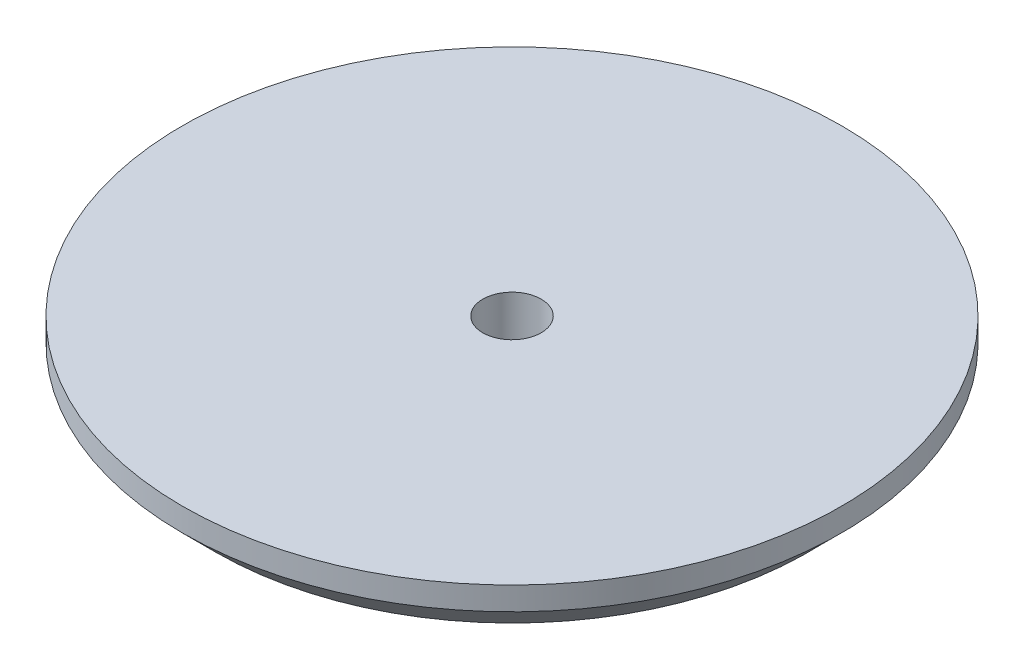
from build123d import *

# Parameters (mm, degrees)
ESQUISSE2_R             = 3.1
ENL_V_MAT_EXTRU_1_DEPTH = 50.859803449


with BuildPart() as part:
    # Esquisse1 → R_volution1 (revolve)
    with BuildSketch(Plane.XY, mode=Mode.PRIVATE) as r_volution1_sk:
        Polygon((35, 6), (0, 6), (0, 0), (31.464466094, 0), (35, 3.535533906), align=None)
    revolve(r_volution1_sk.sketch.rotate(Axis((0, 18.075916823, 0), (0, -1, 0)), 90), axis=Axis((0, 18.075916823, 0), (0, -1, 0)))

    # Esquisse2 → Enl_v. mat.-Extru.1 (cut, through all)
    with BuildSketch(Plane(origin=(0, 6, 0), x_dir=(-1, 0, 0), z_dir=(0, 1, 0))):
        with Locations(Location((0, 0, 0), (0, 0, 90))):
            Circle(ESQUISSE2_R)
    extrude(amount=-ENL_V_MAT_EXTRU_1_DEPTH, mode=Mode.SUBTRACT)


solid = part.part
